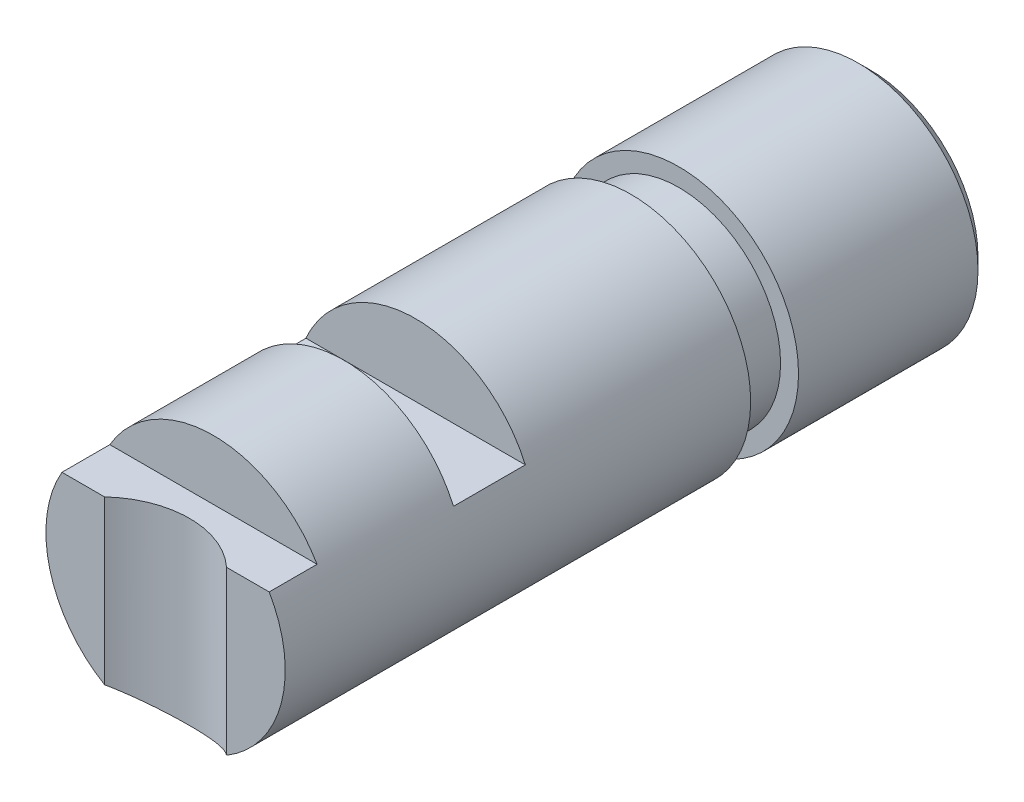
ISO-10303-21;
HEADER;
FILE_DESCRIPTION(('STEP AP214'),'2;1');
FILE_NAME('part.step','',(''),(''),'','','');
FILE_SCHEMA(('AUTOMOTIVE_DESIGN { 1 0 10303 214 1 1 1 1 }'));
ENDSEC;
DATA;
#1=APPLICATION_CONTEXT('core data for automotive mechanical design processes');
#2=APPLICATION_PROTOCOL_DEFINITION('international standard','automotive_design',2000,#1);
#3=PRODUCT_CONTEXT('',#1,'mechanical');
#4=PRODUCT('Part','Part','',(#3));
#5=PRODUCT_RELATED_PRODUCT_CATEGORY('part','',(#4));
#6=PRODUCT_DEFINITION_FORMATION('','',#4);
#7=PRODUCT_DEFINITION_CONTEXT('part definition',#1,'design');
#8=PRODUCT_DEFINITION('design','',#6,#7);
#9=PRODUCT_DEFINITION_SHAPE('','',#8);
#10=(LENGTH_UNIT() NAMED_UNIT(*) SI_UNIT(.MILLI.,.METRE.));
#11=(NAMED_UNIT(*) PLANE_ANGLE_UNIT() SI_UNIT($,.RADIAN.));
#12=(NAMED_UNIT(*) SI_UNIT($,.STERADIAN.) SOLID_ANGLE_UNIT());
#13=UNCERTAINTY_MEASURE_WITH_UNIT(LENGTH_MEASURE(1.E-05),#10,'distance_accuracy_value','');
#14=(GEOMETRIC_REPRESENTATION_CONTEXT(3) GLOBAL_UNCERTAINTY_ASSIGNED_CONTEXT((#13)) GLOBAL_UNIT_ASSIGNED_CONTEXT((#10,
#11,#12)) REPRESENTATION_CONTEXT('',''));
#15=CARTESIAN_POINT('',(0.,0.,0.));
#16=DIRECTION('',(0.,0.,1.));
#17=DIRECTION('',(1.,0.,0.));
#18=AXIS2_PLACEMENT_3D('',#15,#16,#17);
#19=CARTESIAN_POINT('',(0.,0.,29.45));
#20=DIRECTION('',(0.,0.,1.));
#21=DIRECTION('',(1.,0.,0.));
#22=AXIS2_PLACEMENT_3D('',#19,#20,#21);
#23=PLANE('',#22);
#24=DIRECTION('',(0.,1.,0.));
#25=VECTOR('',#24,1.);
#26=CARTESIAN_POINT('',(2.5495097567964,-5.,29.45));
#27=LINE('',#26,#25);
#28=CARTESIAN_POINT('',(2.5495097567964,-4.30116263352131,29.45));
#29=VERTEX_POINT('',#28);
#30=CARTESIAN_POINT('',(2.5495097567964,2.5,29.45));
#31=VERTEX_POINT('',#30);
#32=EDGE_CURVE('E47',#29,#31,#27,.T.);
#33=ORIENTED_EDGE('',*,*,#32,.F.);
#34=CARTESIAN_POINT('',(0.,0.,29.45));
#35=DIRECTION('',(0.,0.,1.));
#36=DIRECTION('',(1.,0.,0.));
#37=AXIS2_PLACEMENT_3D('',#34,#35,#36);
#38=CIRCLE('',#37,5.);
#39=CARTESIAN_POINT('',(4.3301270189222,2.5,29.45));
#40=VERTEX_POINT('',#39);
#41=EDGE_CURVE('E122',#29,#40,#38,.T.);
#42=ORIENTED_EDGE('',*,*,#41,.T.);
#43=DIRECTION('',(-1.,0.,0.));
#44=VECTOR('',#43,1.);
#45=CARTESIAN_POINT('',(0.,2.5,29.45));
#46=LINE('',#45,#44);
#47=EDGE_CURVE('E40',#40,#31,#46,.T.);
#48=ORIENTED_EDGE('',*,*,#47,.T.);
#49=EDGE_LOOP('',(#33,#42,#48));
#50=FACE_BOUND('',#49,.T.);
#51=ADVANCED_FACE('F31',(#50),#23,.T.);
#52=CARTESIAN_POINT('',(0.,0.,29.45));
#53=DIRECTION('',(0.,0.,-1.));
#54=DIRECTION('',(-1.,0.,0.));
#55=AXIS2_PLACEMENT_3D('',#52,#53,#54);
#56=CYLINDRICAL_SURFACE('',#55,5.);
#57=CARTESIAN_POINT('',(0.,0.,22.));
#58=DIRECTION('',(0.,0.,-1.));
#59=DIRECTION('',(-1.,0.,0.));
#60=AXIS2_PLACEMENT_3D('',#57,#58,#59);
#61=CIRCLE('',#60,5.);
#62=CARTESIAN_POINT('',(-4.58257569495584,2.,22.));
#63=VERTEX_POINT('',#62);
#64=CARTESIAN_POINT('',(4.58257569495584,2.,22.));
#65=VERTEX_POINT('',#64);
#66=EDGE_CURVE('E101',#63,#65,#61,.T.);
#67=ORIENTED_EDGE('',*,*,#66,.F.);
#68=DIRECTION('',(0.,0.,-1.));
#69=VECTOR('',#68,1.);
#70=CARTESIAN_POINT('',(-4.58257569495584,2.,29.45));
#71=LINE('',#70,#69);
#72=CARTESIAN_POINT('',(-4.58257569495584,2.,19.));
#73=VERTEX_POINT('',#72);
#74=EDGE_CURVE('E102',#63,#73,#71,.T.);
#75=ORIENTED_EDGE('',*,*,#74,.T.);
#76=CARTESIAN_POINT('',(0.,0.,19.));
#77=DIRECTION('',(0.,0.,-1.));
#78=DIRECTION('',(-1.,0.,0.));
#79=AXIS2_PLACEMENT_3D('',#76,#77,#78);
#80=CIRCLE('',#79,5.);
#81=CARTESIAN_POINT('',(4.58257569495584,2.,19.));
#82=VERTEX_POINT('',#81);
#83=EDGE_CURVE('E110',#73,#82,#80,.T.);
#84=ORIENTED_EDGE('',*,*,#83,.T.);
#85=DIRECTION('',(0.,0.,-1.));
#86=VECTOR('',#85,1.);
#87=CARTESIAN_POINT('',(4.58257569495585,2.,29.45));
#88=LINE('',#87,#86);
#89=EDGE_CURVE('E107',#82,#65,#88,.F.);
#90=ORIENTED_EDGE('',*,*,#89,.T.);
#91=EDGE_LOOP('',(#67,#75,#84,#90));
#92=FACE_BOUND('',#91,.T.);
#93=CARTESIAN_POINT('',(0.,0.,10.));
#94=DIRECTION('',(0.,0.,1.));
#95=DIRECTION('',(1.,0.,0.));
#96=AXIS2_PLACEMENT_3D('',#93,#94,#95);
#97=CIRCLE('',#96,5.);
#98=CARTESIAN_POINT('',(5.,0.,10.));
#99=VERTEX_POINT('',#98);
#100=EDGE_CURVE('E119',#99,#99,#97,.T.);
#101=ORIENTED_EDGE('',*,*,#100,.T.);
#102=EDGE_LOOP('',(#101));
#103=FACE_BOUND('',#102,.T.);
#104=ORIENTED_EDGE('',*,*,#41,.F.);
#105=CARTESIAN_POINT('',(2.5495097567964,-4.30116263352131,29.45));
#106=CARTESIAN_POINT('',(2.4791455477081,-4.34287839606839,29.3847720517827));
#107=CARTESIAN_POINT('',(2.40603205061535,-4.38387537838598,29.3220048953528));
#108=CARTESIAN_POINT('',(2.25438972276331,-4.46374966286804,29.2017319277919));
#109=CARTESIAN_POINT('',(2.17585600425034,-4.5026249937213,29.1442309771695));
#110=CARTESIAN_POINT('',(2.01288060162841,-4.57782027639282,29.0344760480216));
#111=CARTESIAN_POINT('',(1.92839350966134,-4.61411508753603,28.9822720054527));
#112=CARTESIAN_POINT('',(1.75440298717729,-4.68303554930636,28.8841983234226));
#113=CARTESIAN_POINT('',(1.66490045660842,-4.71566185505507,28.8383275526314));
#114=CARTESIAN_POINT('',(1.48064927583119,-4.77673074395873,28.7531838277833));
#115=CARTESIAN_POINT('',(1.38587025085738,-4.80514469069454,28.7139557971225));
#116=CARTESIAN_POINT('',(1.19221784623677,-4.85681482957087,28.6430716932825));
#117=CARTESIAN_POINT('',(1.09334700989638,-4.88007417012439,28.6114109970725));
#118=CARTESIAN_POINT('',(0.89256454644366,-4.92075005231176,28.556289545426));
#119=CARTESIAN_POINT('',(0.790665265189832,-4.93818750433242,28.5327994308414));
#120=CARTESIAN_POINT('',(0.584415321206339,-4.96681897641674,28.4943345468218));
#121=CARTESIAN_POINT('',(0.48006515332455,-4.97801424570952,28.4793580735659));
#122=CARTESIAN_POINT('',(0.284129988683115,-4.99275327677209,28.4596630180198));
#123=CARTESIAN_POINT('',(0.192716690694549,-4.99712391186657,28.4538353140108));
#124=CARTESIAN_POINT('',(0.00957360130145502,-5.0008298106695,28.448893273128));
#125=CARTESIAN_POINT('',(-0.0821562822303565,-5.00016345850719,28.4497810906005));
#126=CARTESIAN_POINT('',(-0.265112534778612,-4.99380494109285,28.458262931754));
#127=CARTESIAN_POINT('',(-0.356339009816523,-4.9881138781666,28.4658554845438));
#128=CARTESIAN_POINT('',(-0.537577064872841,-4.97185168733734,28.4876074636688));
#129=CARTESIAN_POINT('',(-0.627588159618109,-4.96127866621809,28.5017694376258));
#130=CARTESIAN_POINT('',(-0.881510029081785,-4.92448868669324,28.5512235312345));
#131=CARTESIAN_POINT('',(-1.04318452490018,-4.89261391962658,28.5942435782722));
#132=CARTESIAN_POINT('',(-1.3565468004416,-4.81518139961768,28.7000340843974));
#133=CARTESIAN_POINT('',(-1.50821803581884,-4.76960163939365,28.7628363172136));
#134=CARTESIAN_POINT('',(-1.82084864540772,-4.66002324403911,28.916457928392));
#135=CARTESIAN_POINT('',(-1.97984360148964,-4.59429467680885,29.0100526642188));
#136=CARTESIAN_POINT('',(-2.20422215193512,-4.48867938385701,29.1648473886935));
#137=CARTESIAN_POINT('',(-2.27654959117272,-4.45237278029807,29.2187403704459));
#138=CARTESIAN_POINT('',(-2.41652650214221,-4.37797471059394,29.3310428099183));
#139=CARTESIAN_POINT('',(-2.48417976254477,-4.33988473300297,29.3894485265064));
#140=CARTESIAN_POINT('',(-2.54950975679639,-4.30116263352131,29.45));
#141=B_SPLINE_CURVE_WITH_KNOTS('',3,(#105,#106,#107,#108,#109,#110,#111,#112,#113,#114,#115,
#116,#117,#118,#119,#120,#121,#122,#123,#124,#125,#126,#127,#128,#129,#130,#131,#132,#133,#134,
#135,#136,#137,#138,#139,#140),.UNSPECIFIED.,.F.,.F.,(4,2,2,2,2,2,2,2,2,2,2,2,2,2,2,2,2,4),(0.,
0.313844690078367,0.627976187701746,0.944837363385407,1.26164186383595,1.58050997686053,
1.89918278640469,2.21669839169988,2.53415043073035,2.80888664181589,3.08371099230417,
3.35847506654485,3.63334578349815,4.14191909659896,4.65131347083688,5.23633887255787,
5.52784384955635,5.81910970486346),.UNSPECIFIED.);
#142=CARTESIAN_POINT('',(-2.54950975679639,-4.30116263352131,29.45));
#143=VERTEX_POINT('',#142);
#144=EDGE_CURVE('E95',#29,#143,#141,.T.);
#145=ORIENTED_EDGE('',*,*,#144,.T.);
#146=CARTESIAN_POINT('',(-4.33012701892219,2.5,29.45));
#147=VERTEX_POINT('',#146);
#148=EDGE_CURVE('E94',#147,#143,#38,.T.);
#149=ORIENTED_EDGE('',*,*,#148,.F.);
#150=DIRECTION('',(0.,0.,-1.));
#151=VECTOR('',#150,1.);
#152=CARTESIAN_POINT('',(-4.33012701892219,2.5,29.45));
#153=LINE('',#152,#151);
#154=CARTESIAN_POINT('',(-4.33012701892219,2.5,27.45));
#155=VERTEX_POINT('',#154);
#156=EDGE_CURVE('E100',#155,#147,#153,.F.);
#157=ORIENTED_EDGE('',*,*,#156,.F.);
#158=CARTESIAN_POINT('',(0.,0.,27.45));
#159=DIRECTION('',(0.,0.,-1.));
#160=DIRECTION('',(-1.,0.,0.));
#161=AXIS2_PLACEMENT_3D('',#158,#159,#160);
#162=CIRCLE('',#161,5.);
#163=CARTESIAN_POINT('',(4.33012701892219,2.5,27.45));
#164=VERTEX_POINT('',#163);
#165=EDGE_CURVE('E12',#155,#164,#162,.T.);
#166=ORIENTED_EDGE('',*,*,#165,.T.);
#167=DIRECTION('',(0.,0.,-1.));
#168=VECTOR('',#167,1.);
#169=CARTESIAN_POINT('',(4.3301270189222,2.5,29.45));
#170=LINE('',#169,#168);
#171=EDGE_CURVE('E139',#40,#164,#170,.T.);
#172=ORIENTED_EDGE('',*,*,#171,.F.);
#173=EDGE_LOOP('',(#104,#145,#149,#157,#166,#172));
#174=FACE_BOUND('',#173,.T.);
#175=ADVANCED_FACE('F33',(#92,#103,#174),#56,.T.);
#176=DIRECTION('',(0.,1.,0.));
#177=VECTOR('',#176,1.);
#178=CARTESIAN_POINT('',(-2.54950975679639,-5.,29.45));
#179=LINE('',#178,#177);
#180=CARTESIAN_POINT('',(-2.54950975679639,2.5,29.45));
#181=VERTEX_POINT('',#180);
#182=EDGE_CURVE('E87',#181,#143,#179,.F.);
#183=ORIENTED_EDGE('',*,*,#182,.F.);
#184=EDGE_CURVE('E55',#181,#147,#46,.T.);
#185=ORIENTED_EDGE('',*,*,#184,.T.);
#186=ORIENTED_EDGE('',*,*,#148,.T.);
#187=EDGE_LOOP('',(#183,#185,#186));
#188=FACE_BOUND('',#187,.T.);
#189=ADVANCED_FACE('F92',(#188),#23,.T.);
#190=CARTESIAN_POINT('',(0.,0.,10.));
#191=DIRECTION('',(0.,0.,1.));
#192=DIRECTION('',(1.,0.,0.));
#193=AXIS2_PLACEMENT_3D('',#190,#191,#192);
#194=PLANE('',#193);
#195=CARTESIAN_POINT('',(0.,0.,10.));
#196=DIRECTION('',(0.,0.,1.));
#197=DIRECTION('',(1.,0.,0.));
#198=AXIS2_PLACEMENT_3D('',#195,#196,#197);
#199=CIRCLE('',#198,4.25);
#200=CARTESIAN_POINT('',(4.25,0.,10.));
#201=VERTEX_POINT('',#200);
#202=EDGE_CURVE('E126',#201,#201,#199,.T.);
#203=ORIENTED_EDGE('',*,*,#202,.T.);
#204=EDGE_LOOP('',(#203));
#205=FACE_BOUND('',#204,.T.);
#206=ORIENTED_EDGE('',*,*,#100,.F.);
#207=EDGE_LOOP('',(#206));
#208=FACE_BOUND('',#207,.T.);
#209=ADVANCED_FACE('F183',(#205,#208),#194,.F.);
#210=CARTESIAN_POINT('',(0.,0.,8.));
#211=DIRECTION('',(0.,0.,1.));
#212=DIRECTION('',(1.,0.,0.));
#213=AXIS2_PLACEMENT_3D('',#210,#211,#212);
#214=PLANE('',#213);
#215=CARTESIAN_POINT('',(0.,0.,8.));
#216=DIRECTION('',(0.,0.,1.));
#217=DIRECTION('',(1.,0.,0.));
#218=AXIS2_PLACEMENT_3D('',#215,#216,#217);
#219=CIRCLE('',#218,4.25);
#220=CARTESIAN_POINT('',(4.25,0.,8.));
#221=VERTEX_POINT('',#220);
#222=EDGE_CURVE('E130',#221,#221,#219,.T.);
#223=ORIENTED_EDGE('',*,*,#222,.F.);
#224=EDGE_LOOP('',(#223));
#225=FACE_BOUND('',#224,.T.);
#226=CARTESIAN_POINT('',(0.,0.,8.));
#227=DIRECTION('',(0.,0.,1.));
#228=DIRECTION('',(1.,0.,0.));
#229=AXIS2_PLACEMENT_3D('',#226,#227,#228);
#230=CIRCLE('',#229,5.);
#231=CARTESIAN_POINT('',(-5.,0.,8.));
#232=VERTEX_POINT('',#231);
#233=EDGE_CURVE('E123',#232,#232,#230,.T.);
#234=ORIENTED_EDGE('',*,*,#233,.T.);
#235=EDGE_LOOP('',(#234));
#236=FACE_BOUND('',#235,.T.);
#237=ADVANCED_FACE('F179',(#225,#236),#214,.T.);
#238=CARTESIAN_POINT('',(0.,0.,10.));
#239=DIRECTION('',(0.,0.,-1.));
#240=DIRECTION('',(-1.,0.,0.));
#241=AXIS2_PLACEMENT_3D('',#238,#239,#240);
#242=CYLINDRICAL_SURFACE('',#241,4.25);
#243=ORIENTED_EDGE('',*,*,#202,.F.);
#244=EDGE_LOOP('',(#243));
#245=FACE_BOUND('',#244,.T.);
#246=ORIENTED_EDGE('',*,*,#222,.T.);
#247=EDGE_LOOP('',(#246));
#248=FACE_BOUND('',#247,.T.);
#249=ADVANCED_FACE('F175',(#245,#248),#242,.T.);
#250=CARTESIAN_POINT('',(0.,0.,0.));
#251=DIRECTION('',(0.,0.,1.));
#252=DIRECTION('',(1.,0.,0.));
#253=AXIS2_PLACEMENT_3D('',#250,#251,#252);
#254=PLANE('',#253);
#255=CARTESIAN_POINT('',(0.,0.,0.));
#256=DIRECTION('',(0.,0.,1.));
#257=DIRECTION('',(1.,0.,0.));
#258=AXIS2_PLACEMENT_3D('',#255,#256,#257);
#259=CIRCLE('',#258,4.49999999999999);
#260=CARTESIAN_POINT('',(4.49999999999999,0.,0.));
#261=VERTEX_POINT('',#260);
#262=EDGE_CURVE('E113',#261,#261,#259,.F.);
#263=ORIENTED_EDGE('',*,*,#262,.T.);
#264=EDGE_LOOP('',(#263));
#265=FACE_BOUND('',#264,.T.);
#266=ADVANCED_FACE('F178',(#265),#254,.F.);
#267=CARTESIAN_POINT('',(0.,0.,0.500000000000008));
#268=DIRECTION('',(0.,0.,1.));
#269=DIRECTION('',(1.,0.,0.));
#270=AXIS2_PLACEMENT_3D('',#267,#268,#269);
#271=CIRCLE('',#270,5.);
#272=CARTESIAN_POINT('',(-5.,0.,0.500000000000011));
#273=VERTEX_POINT('',#272);
#274=EDGE_CURVE('E116',#273,#273,#271,.T.);
#275=CARTESIAN_POINT('',(-5.,0.,0.500000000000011));
#276=CARTESIAN_POINT('',(-5.,0.,0.57812500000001));
#277=CARTESIAN_POINT('',(-5.,0.,0.65625000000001));
#278=CARTESIAN_POINT('',(-5.,0.,0.81250000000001));
#279=CARTESIAN_POINT('',(-5.,0.,0.890625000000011));
#280=CARTESIAN_POINT('',(-5.,0.,1.04687500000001));
#281=CARTESIAN_POINT('',(-5.,0.,1.12500000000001));
#282=CARTESIAN_POINT('',(-5.,0.,1.28125000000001));
#283=CARTESIAN_POINT('',(-5.,0.,1.35937500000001));
#284=CARTESIAN_POINT('',(-5.,0.,1.51562500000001));
#285=CARTESIAN_POINT('',(-5.,0.,1.59375000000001));
#286=CARTESIAN_POINT('',(-5.,0.,1.75000000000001));
#287=CARTESIAN_POINT('',(-5.,0.,1.82812500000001));
#288=CARTESIAN_POINT('',(-5.,0.,1.98437500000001));
#289=CARTESIAN_POINT('',(-5.,0.,2.06250000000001));
#290=CARTESIAN_POINT('',(-5.,0.,2.21875000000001));
#291=CARTESIAN_POINT('',(-5.,0.,2.29687500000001));
#292=CARTESIAN_POINT('',(-5.,0.,2.45312500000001));
#293=CARTESIAN_POINT('',(-5.,0.,2.53125000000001));
#294=CARTESIAN_POINT('',(-5.,0.,2.68750000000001));
#295=CARTESIAN_POINT('',(-5.,0.,2.76562500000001));
#296=CARTESIAN_POINT('',(-5.,0.,2.92187500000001));
#297=CARTESIAN_POINT('',(-5.,0.,3.00000000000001));
#298=CARTESIAN_POINT('',(-5.,0.,3.15625000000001));
#299=CARTESIAN_POINT('',(-5.,0.,3.23437500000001));
#300=CARTESIAN_POINT('',(-5.,0.,3.39062500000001));
#301=CARTESIAN_POINT('',(-5.,0.,3.46875000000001));
#302=CARTESIAN_POINT('',(-5.,0.,3.62500000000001));
#303=CARTESIAN_POINT('',(-5.,0.,3.70312500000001));
#304=CARTESIAN_POINT('',(-5.,0.,3.85937500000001));
#305=CARTESIAN_POINT('',(-5.,0.,3.93750000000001));
#306=CARTESIAN_POINT('',(-5.,0.,4.09375000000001));
#307=CARTESIAN_POINT('',(-5.,0.,4.17187500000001));
#308=CARTESIAN_POINT('',(-5.,0.,4.32812500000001));
#309=CARTESIAN_POINT('',(-5.,0.,4.40625000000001));
#310=CARTESIAN_POINT('',(-5.,0.,4.56250000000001));
#311=CARTESIAN_POINT('',(-5.,0.,4.64062500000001));
#312=CARTESIAN_POINT('',(-5.,0.,4.79687500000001));
#313=CARTESIAN_POINT('',(-5.,0.,4.87500000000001));
#314=CARTESIAN_POINT('',(-5.,0.,5.03125000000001));
#315=CARTESIAN_POINT('',(-5.,0.,5.10937500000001));
#316=CARTESIAN_POINT('',(-5.,0.,5.26562500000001));
#317=CARTESIAN_POINT('',(-5.,0.,5.34375000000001));
#318=CARTESIAN_POINT('',(-5.,0.,5.50000000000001));
#319=CARTESIAN_POINT('',(-5.,0.,5.57812500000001));
#320=CARTESIAN_POINT('',(-5.,0.,5.73437500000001));
#321=CARTESIAN_POINT('',(-5.,0.,5.81250000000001));
#322=CARTESIAN_POINT('',(-5.,0.,5.96875000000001));
#323=CARTESIAN_POINT('',(-5.,0.,6.04687500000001));
#324=CARTESIAN_POINT('',(-5.,0.,6.203125));
#325=CARTESIAN_POINT('',(-5.,0.,6.28125));
#326=CARTESIAN_POINT('',(-5.,0.,6.4375));
#327=CARTESIAN_POINT('',(-5.,0.,6.51562500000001));
#328=CARTESIAN_POINT('',(-5.,0.,6.67187500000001));
#329=CARTESIAN_POINT('',(-5.,0.,6.75000000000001));
#330=CARTESIAN_POINT('',(-5.,0.,6.90625));
#331=CARTESIAN_POINT('',(-5.,0.,6.984375));
#332=CARTESIAN_POINT('',(-5.,0.,7.140625));
#333=CARTESIAN_POINT('',(-5.,0.,7.21875));
#334=CARTESIAN_POINT('',(-5.,0.,7.375));
#335=CARTESIAN_POINT('',(-5.,0.,7.453125));
#336=CARTESIAN_POINT('',(-5.,0.,7.609375));
#337=CARTESIAN_POINT('',(-5.,0.,7.6875));
#338=CARTESIAN_POINT('',(-5.,0.,7.84375));
#339=CARTESIAN_POINT('',(-5.,0.,7.921875));
#340=CARTESIAN_POINT('',(-5.,0.,8.));
#341=B_SPLINE_CURVE_WITH_KNOTS('',3,(#275,#276,#277,#278,#279,#280,#281,#282,#283,#284,#285,
#286,#287,#288,#289,#290,#291,#292,#293,#294,#295,#296,#297,#298,#299,#300,#301,#302,#303,#304,
#305,#306,#307,#308,#309,#310,#311,#312,#313,#314,#315,#316,#317,#318,#319,#320,#321,#322,#323,
#324,#325,#326,#327,#328,#329,#330,#331,#332,#333,#334,#335,#336,#337,#338,#339,#340),
.UNSPECIFIED.,.F.,.F.,(4,2,2,2,2,2,2,2,2,2,2,2,2,2,2,2,2,2,2,2,2,2,2,2,2,2,2,2,2,2,2,2,4),(0.,
0.234374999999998,0.46875,0.703124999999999,0.937500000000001,1.171875,1.40625,1.640625,1.875,
2.109375,2.34375,2.578125,2.8125,3.046875,3.28125,3.515625,3.75,3.984375,4.21875,4.453125,
4.6875,4.921875,5.15624999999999,5.390625,5.62499999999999,5.85937499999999,6.09374999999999,
6.32812499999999,6.56249999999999,6.79687499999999,7.03124999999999,7.26562499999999,
7.49999999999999),.UNSPECIFIED.);
#342=EDGE_CURVE('BSEAM173',#273,#232,#341,.T.);
#343=ORIENTED_EDGE('',*,*,#274,.T.);
#344=ORIENTED_EDGE('',*,*,#233,.F.);
#345=ORIENTED_EDGE('',*,*,#342,.T.);
#346=ORIENTED_EDGE('',*,*,#342,.F.);
#347=EDGE_LOOP('',(#343,#345,#344,#346));
#348=FACE_BOUND('',#347,.T.);
#349=ADVANCED_FACE('F173',(#348),#56,.T.);
#350=CARTESIAN_POINT('',(0.,0.,0.500000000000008));
#351=DIRECTION('',(0.,0.,1.));
#352=DIRECTION('',(1.,0.,0.));
#353=AXIS2_PLACEMENT_3D('',#350,#351,#352);
#354=CONICAL_SURFACE('',#353,5.,0.785398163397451);
#355=ORIENTED_EDGE('',*,*,#262,.F.);
#356=EDGE_LOOP('',(#355));
#357=FACE_BOUND('',#356,.T.);
#358=ORIENTED_EDGE('',*,*,#274,.F.);
#359=EDGE_LOOP('',(#358));
#360=FACE_BOUND('',#359,.T.);
#361=ADVANCED_FACE('F169',(#357,#360),#354,.T.);
#362=CARTESIAN_POINT('',(5.23304403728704,2.,22.));
#363=DIRECTION('',(0.,-1.,0.));
#364=DIRECTION('',(0.,0.,-1.));
#365=AXIS2_PLACEMENT_3D('',#362,#363,#364);
#366=PLANE('',#365);
#367=DIRECTION('',(-1.,0.,0.));
#368=VECTOR('',#367,1.);
#369=CARTESIAN_POINT('',(5.23304403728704,2.,22.));
#370=LINE('',#369,#368);
#371=EDGE_CURVE('E133',#65,#63,#370,.T.);
#372=ORIENTED_EDGE('',*,*,#371,.F.);
#373=ORIENTED_EDGE('',*,*,#89,.F.);
#374=DIRECTION('',(-1.,0.,0.));
#375=VECTOR('',#374,1.);
#376=CARTESIAN_POINT('',(5.23304403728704,2.,19.));
#377=LINE('',#376,#375);
#378=EDGE_CURVE('E136',#82,#73,#377,.T.);
#379=ORIENTED_EDGE('',*,*,#378,.T.);
#380=ORIENTED_EDGE('',*,*,#74,.F.);
#381=EDGE_LOOP('',(#372,#373,#379,#380));
#382=FACE_BOUND('',#381,.T.);
#383=ADVANCED_FACE('F165',(#382),#366,.F.);
#384=CARTESIAN_POINT('',(5.23304403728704,2.,22.));
#385=DIRECTION('',(0.,0.,-1.));
#386=DIRECTION('',(-1.,0.,0.));
#387=AXIS2_PLACEMENT_3D('',#384,#385,#386);
#388=PLANE('',#387);
#389=ORIENTED_EDGE('',*,*,#66,.T.);
#390=ORIENTED_EDGE('',*,*,#371,.T.);
#391=EDGE_LOOP('',(#389,#390));
#392=FACE_BOUND('',#391,.T.);
#393=ADVANCED_FACE('F161',(#392),#388,.T.);
#394=CARTESIAN_POINT('',(5.23304403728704,2.,19.));
#395=DIRECTION('',(0.,0.,-1.));
#396=DIRECTION('',(-1.,0.,0.));
#397=AXIS2_PLACEMENT_3D('',#394,#395,#396);
#398=PLANE('',#397);
#399=ORIENTED_EDGE('',*,*,#378,.F.);
#400=ORIENTED_EDGE('',*,*,#83,.F.);
#401=EDGE_LOOP('',(#399,#400));
#402=FACE_BOUND('',#401,.T.);
#403=ADVANCED_FACE('F157',(#402),#398,.F.);
#404=CARTESIAN_POINT('',(5.,2.5,27.45));
#405=DIRECTION('',(0.,0.,-1.));
#406=DIRECTION('',(-1.,0.,0.));
#407=AXIS2_PLACEMENT_3D('',#404,#405,#406);
#408=PLANE('',#407);
#409=DIRECTION('',(-1.,0.,0.));
#410=VECTOR('',#409,1.);
#411=CARTESIAN_POINT('',(5.,2.5,27.45));
#412=LINE('',#411,#410);
#413=EDGE_CURVE('E142',#164,#155,#412,.T.);
#414=ORIENTED_EDGE('',*,*,#413,.F.);
#415=ORIENTED_EDGE('',*,*,#165,.F.);
#416=EDGE_LOOP('',(#414,#415));
#417=FACE_BOUND('',#416,.T.);
#418=ADVANCED_FACE('F154',(#417),#408,.F.);
#419=CARTESIAN_POINT('',(-5.,2.5,29.45));
#420=DIRECTION('',(0.,1.,0.));
#421=DIRECTION('',(0.,0.,1.));
#422=AXIS2_PLACEMENT_3D('',#419,#420,#421);
#423=PLANE('',#422);
#424=CARTESIAN_POINT('',(0.,2.5,32.2));
#425=DIRECTION('',(0.,1.,0.));
#426=DIRECTION('',(0.,0.,1.));
#427=AXIS2_PLACEMENT_3D('',#424,#425,#426);
#428=CIRCLE('',#427,3.75);
#429=EDGE_CURVE('E85',#31,#181,#428,.T.);
#430=ORIENTED_EDGE('',*,*,#429,.F.);
#431=ORIENTED_EDGE('',*,*,#47,.F.);
#432=ORIENTED_EDGE('',*,*,#171,.T.);
#433=ORIENTED_EDGE('',*,*,#413,.T.);
#434=ORIENTED_EDGE('',*,*,#156,.T.);
#435=ORIENTED_EDGE('',*,*,#184,.F.);
#436=EDGE_LOOP('',(#430,#431,#432,#433,#434,#435));
#437=FACE_BOUND('',#436,.T.);
#438=ADVANCED_FACE('F97',(#437),#423,.T.);
#439=CARTESIAN_POINT('',(0.,-5.,32.2));
#440=DIRECTION('',(0.,1.,0.));
#441=DIRECTION('',(0.,0.,1.));
#442=AXIS2_PLACEMENT_3D('',#439,#440,#441);
#443=CYLINDRICAL_SURFACE('',#442,3.75);
#444=ORIENTED_EDGE('',*,*,#32,.T.);
#445=ORIENTED_EDGE('',*,*,#429,.T.);
#446=ORIENTED_EDGE('',*,*,#182,.T.);
#447=ORIENTED_EDGE('',*,*,#144,.F.);
#448=EDGE_LOOP('',(#444,#445,#446,#447));
#449=FACE_BOUND('',#448,.T.);
#450=ADVANCED_FACE('F86',(#449),#443,.F.);
#451=CLOSED_SHELL('',(#51,#175,#189,#209,#237,#249,#266,#349,#361,#383,#393,#403,#418,#438,#450));
#452=MANIFOLD_SOLID_BREP('B2',#451);
#453=ADVANCED_BREP_SHAPE_REPRESENTATION('',(#18,#452),#14);
#454=SHAPE_DEFINITION_REPRESENTATION(#9,#453);
ENDSEC;
END-ISO-10303-21;
